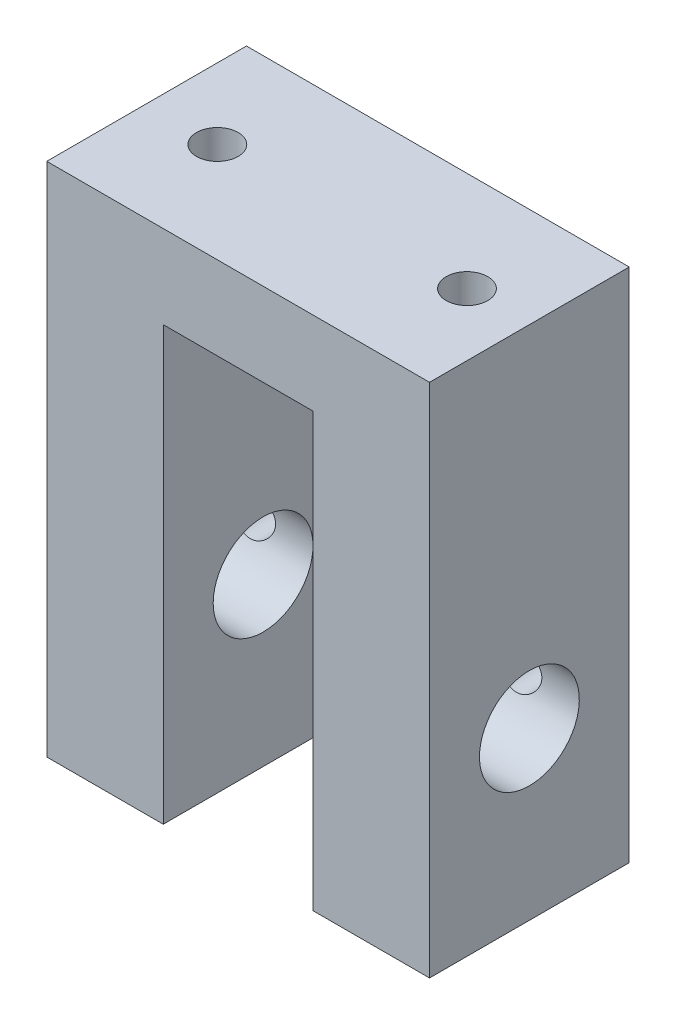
ISO-10303-21;
HEADER;
FILE_DESCRIPTION(('STEP AP214'),'2;1');
FILE_NAME('part.step','',(''),(''),'','','');
FILE_SCHEMA(('AUTOMOTIVE_DESIGN { 1 0 10303 214 1 1 1 1 }'));
ENDSEC;
DATA;
#1=APPLICATION_CONTEXT('core data for automotive mechanical design processes');
#2=APPLICATION_PROTOCOL_DEFINITION('international standard','automotive_design',2000,#1);
#3=PRODUCT_CONTEXT('',#1,'mechanical');
#4=PRODUCT('Part','Part','',(#3));
#5=PRODUCT_RELATED_PRODUCT_CATEGORY('part','',(#4));
#6=PRODUCT_DEFINITION_FORMATION('','',#4);
#7=PRODUCT_DEFINITION_CONTEXT('part definition',#1,'design');
#8=PRODUCT_DEFINITION('design','',#6,#7);
#9=PRODUCT_DEFINITION_SHAPE('','',#8);
#10=(LENGTH_UNIT() NAMED_UNIT(*) SI_UNIT(.MILLI.,.METRE.));
#11=(NAMED_UNIT(*) PLANE_ANGLE_UNIT() SI_UNIT($,.RADIAN.));
#12=(NAMED_UNIT(*) SI_UNIT($,.STERADIAN.) SOLID_ANGLE_UNIT());
#13=UNCERTAINTY_MEASURE_WITH_UNIT(LENGTH_MEASURE(1.E-05),#10,'distance_accuracy_value','');
#14=(GEOMETRIC_REPRESENTATION_CONTEXT(3) GLOBAL_UNCERTAINTY_ASSIGNED_CONTEXT((#13)) GLOBAL_UNIT_ASSIGNED_CONTEXT((#10,
#11,#12)) REPRESENTATION_CONTEXT('',''));
#15=CARTESIAN_POINT('',(0.,0.,0.));
#16=DIRECTION('',(0.,0.,1.));
#17=DIRECTION('',(1.,0.,0.));
#18=AXIS2_PLACEMENT_3D('',#15,#16,#17);
#19=CARTESIAN_POINT('',(-46.6487534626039,-15.6502770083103,24.));
#20=DIRECTION('',(0.,1.,0.));
#21=DIRECTION('',(0.,0.,1.));
#22=AXIS2_PLACEMENT_3D('',#19,#20,#21);
#23=PLANE('',#22);
#24=DIRECTION('',(1.,0.,0.));
#25=VECTOR('',#24,1.);
#26=CARTESIAN_POINT('',(-46.6487534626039,-15.6502770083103,0.));
#27=LINE('',#26,#25);
#28=CARTESIAN_POINT('',(-46.6487534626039,-15.6502770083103,0.));
#29=VERTEX_POINT('',#28);
#30=CARTESIAN_POINT('',(-32.6487534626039,-15.6502770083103,0.));
#31=VERTEX_POINT('',#30);
#32=EDGE_CURVE('E490',#29,#31,#27,.T.);
#33=ORIENTED_EDGE('',*,*,#32,.T.);
#34=DIRECTION('',(0.,0.,1.));
#35=VECTOR('',#34,1.);
#36=CARTESIAN_POINT('',(-32.6487534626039,-15.6502770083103,0.));
#37=LINE('',#36,#35);
#38=CARTESIAN_POINT('',(-32.6487534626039,-15.6502770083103,24.));
#39=VERTEX_POINT('',#38);
#40=EDGE_CURVE('E477',#31,#39,#37,.T.);
#41=ORIENTED_EDGE('',*,*,#40,.T.);
#42=DIRECTION('',(1.,0.,0.));
#43=VECTOR('',#42,1.);
#44=CARTESIAN_POINT('',(-46.6487534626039,-15.6502770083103,24.));
#45=LINE('',#44,#43);
#46=CARTESIAN_POINT('',(-46.6487534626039,-15.6502770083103,24.));
#47=VERTEX_POINT('',#46);
#48=EDGE_CURVE('E500',#47,#39,#45,.T.);
#49=ORIENTED_EDGE('',*,*,#48,.F.);
#50=DIRECTION('',(0.,0.,-1.));
#51=VECTOR('',#50,1.);
#52=CARTESIAN_POINT('',(-46.6487534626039,-15.6502770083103,24.));
#53=LINE('',#52,#51);
#54=EDGE_CURVE('E11',#47,#29,#53,.T.);
#55=ORIENTED_EDGE('',*,*,#54,.T.);
#56=EDGE_LOOP('',(#33,#41,#49,#55));
#57=FACE_BOUND('',#56,.T.);
#58=ADVANCED_FACE('F350',(#57),#23,.F.);
#59=CARTESIAN_POINT('',(-46.6487534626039,46.3497229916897,24.));
#60=DIRECTION('',(1.,0.,0.));
#61=DIRECTION('',(0.,1.,0.));
#62=AXIS2_PLACEMENT_3D('',#59,#60,#61);
#63=PLANE('',#62);
#64=CARTESIAN_POINT('',(-46.6487534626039,4.34972299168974,12.));
#65=DIRECTION('',(1.,0.,0.));
#66=DIRECTION('',(0.,1.,0.));
#67=AXIS2_PLACEMENT_3D('',#64,#65,#66);
#68=CIRCLE('',#67,6.);
#69=CARTESIAN_POINT('',(-46.6487534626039,10.3497229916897,12.));
#70=VERTEX_POINT('',#69);
#71=EDGE_CURVE('E459',#70,#70,#68,.T.);
#72=ORIENTED_EDGE('',*,*,#71,.T.);
#73=EDGE_LOOP('',(#72));
#74=FACE_BOUND('',#73,.T.);
#75=DIRECTION('',(0.,-1.,0.));
#76=VECTOR('',#75,1.);
#77=CARTESIAN_POINT('',(-46.6487534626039,46.3497229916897,0.));
#78=LINE('',#77,#76);
#79=CARTESIAN_POINT('',(-46.6487534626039,46.3497229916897,0.));
#80=VERTEX_POINT('',#79);
#81=EDGE_CURVE('E480',#80,#29,#78,.T.);
#82=ORIENTED_EDGE('',*,*,#81,.T.);
#83=ORIENTED_EDGE('',*,*,#54,.F.);
#84=DIRECTION('',(0.,-1.,0.));
#85=VECTOR('',#84,1.);
#86=CARTESIAN_POINT('',(-46.6487534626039,46.3497229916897,24.));
#87=LINE('',#86,#85);
#88=CARTESIAN_POINT('',(-46.6487534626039,46.3497229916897,24.));
#89=VERTEX_POINT('',#88);
#90=EDGE_CURVE('E497',#89,#47,#87,.T.);
#91=ORIENTED_EDGE('',*,*,#90,.F.);
#92=DIRECTION('',(0.,0.,-1.));
#93=VECTOR('',#92,1.);
#94=CARTESIAN_POINT('',(-46.6487534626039,46.3497229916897,24.));
#95=LINE('',#94,#93);
#96=EDGE_CURVE('E506',#89,#80,#95,.T.);
#97=ORIENTED_EDGE('',*,*,#96,.T.);
#98=EDGE_LOOP('',(#82,#83,#91,#97));
#99=FACE_BOUND('',#98,.T.);
#100=ADVANCED_FACE('F352',(#74,#99),#63,.F.);
#101=CARTESIAN_POINT('',(-14.6487534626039,-15.6502770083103,24.));
#102=VERTEX_POINT('',#101);
#103=CARTESIAN_POINT('',(-0.648753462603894,-15.6502770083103,24.));
#104=VERTEX_POINT('',#103);
#105=EDGE_CURVE('E499',#102,#104,#45,.T.);
#106=ORIENTED_EDGE('',*,*,#105,.F.);
#107=DIRECTION('',(0.,0.,1.));
#108=VECTOR('',#107,1.);
#109=CARTESIAN_POINT('',(-14.6487534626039,-15.6502770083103,0.));
#110=LINE('',#109,#108);
#111=CARTESIAN_POINT('',(-14.6487534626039,-15.6502770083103,0.));
#112=VERTEX_POINT('',#111);
#113=EDGE_CURVE('E483',#112,#102,#110,.T.);
#114=ORIENTED_EDGE('',*,*,#113,.F.);
#115=CARTESIAN_POINT('',(-0.648753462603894,-15.6502770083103,0.));
#116=VERTEX_POINT('',#115);
#117=EDGE_CURVE('E489',#112,#116,#27,.T.);
#118=ORIENTED_EDGE('',*,*,#117,.T.);
#119=DIRECTION('',(0.,0.,-1.));
#120=VECTOR('',#119,1.);
#121=CARTESIAN_POINT('',(-0.648753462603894,-15.6502770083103,24.));
#122=LINE('',#121,#120);
#123=EDGE_CURVE('E363',#104,#116,#122,.T.);
#124=ORIENTED_EDGE('',*,*,#123,.F.);
#125=EDGE_LOOP('',(#106,#114,#118,#124));
#126=FACE_BOUND('',#125,.T.);
#127=ADVANCED_FACE('F545',(#126),#23,.F.);
#128=CARTESIAN_POINT('',(-0.648753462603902,46.3497229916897,24.));
#129=DIRECTION('',(-1.,0.,0.));
#130=DIRECTION('',(0.,-1.,0.));
#131=AXIS2_PLACEMENT_3D('',#128,#129,#130);
#132=PLANE('',#131);
#133=CARTESIAN_POINT('',(-0.648753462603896,4.34972299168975,12.));
#134=DIRECTION('',(1.,0.,0.));
#135=DIRECTION('',(0.,1.,0.));
#136=AXIS2_PLACEMENT_3D('',#133,#134,#135);
#137=CIRCLE('',#136,6.);
#138=CARTESIAN_POINT('',(-0.648753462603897,10.3497229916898,12.));
#139=VERTEX_POINT('',#138);
#140=EDGE_CURVE('E452',#139,#139,#137,.T.);
#141=ORIENTED_EDGE('',*,*,#140,.F.);
#142=EDGE_LOOP('',(#141));
#143=FACE_BOUND('',#142,.T.);
#144=DIRECTION('',(0.,1.,0.));
#145=VECTOR('',#144,1.);
#146=CARTESIAN_POINT('',(-0.648753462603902,46.3497229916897,0.));
#147=LINE('',#146,#145);
#148=CARTESIAN_POINT('',(-0.648753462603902,46.3497229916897,0.));
#149=VERTEX_POINT('',#148);
#150=EDGE_CURVE('E493',#116,#149,#147,.T.);
#151=ORIENTED_EDGE('',*,*,#150,.T.);
#152=DIRECTION('',(0.,0.,-1.));
#153=VECTOR('',#152,1.);
#154=CARTESIAN_POINT('',(-0.648753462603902,46.3497229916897,24.));
#155=LINE('',#154,#153);
#156=CARTESIAN_POINT('',(-0.648753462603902,46.3497229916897,24.));
#157=VERTEX_POINT('',#156);
#158=EDGE_CURVE('E509',#157,#149,#155,.T.);
#159=ORIENTED_EDGE('',*,*,#158,.F.);
#160=DIRECTION('',(0.,1.,0.));
#161=VECTOR('',#160,1.);
#162=CARTESIAN_POINT('',(-0.648753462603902,46.3497229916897,24.));
#163=LINE('',#162,#161);
#164=EDGE_CURVE('E503',#104,#157,#163,.T.);
#165=ORIENTED_EDGE('',*,*,#164,.F.);
#166=ORIENTED_EDGE('',*,*,#123,.T.);
#167=EDGE_LOOP('',(#151,#159,#165,#166));
#168=FACE_BOUND('',#167,.T.);
#169=ADVANCED_FACE('F552',(#143,#168),#132,.F.);
#170=CARTESIAN_POINT('',(-46.6487534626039,46.3497229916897,24.));
#171=DIRECTION('',(0.,-1.,0.));
#172=DIRECTION('',(0.,0.,-1.));
#173=AXIS2_PLACEMENT_3D('',#170,#171,#172);
#174=PLANE('',#173);
#175=CARTESIAN_POINT('',(-8.1487534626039,46.3497229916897,12.));
#176=DIRECTION('',(0.,1.,0.));
#177=DIRECTION('',(0.,0.,1.));
#178=AXIS2_PLACEMENT_3D('',#175,#176,#177);
#179=CIRCLE('',#178,2.49999999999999);
#180=CARTESIAN_POINT('',(-8.1487534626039,46.3497229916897,14.5));
#181=VERTEX_POINT('',#180);
#182=EDGE_CURVE('E436',#181,#181,#179,.T.);
#183=ORIENTED_EDGE('',*,*,#182,.F.);
#184=EDGE_LOOP('',(#183));
#185=FACE_BOUND('',#184,.T.);
#186=CARTESIAN_POINT('',(-38.1487534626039,46.3497229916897,12.));
#187=DIRECTION('',(0.,1.,0.));
#188=DIRECTION('',(0.,0.,1.));
#189=AXIS2_PLACEMENT_3D('',#186,#187,#188);
#190=CIRCLE('',#189,2.49999999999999);
#191=CARTESIAN_POINT('',(-38.1487534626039,46.3497229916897,14.5));
#192=VERTEX_POINT('',#191);
#193=EDGE_CURVE('E449',#192,#192,#190,.T.);
#194=ORIENTED_EDGE('',*,*,#193,.F.);
#195=EDGE_LOOP('',(#194));
#196=FACE_BOUND('',#195,.T.);
#197=DIRECTION('',(-1.,0.,0.));
#198=VECTOR('',#197,1.);
#199=CARTESIAN_POINT('',(-46.6487534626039,46.3497229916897,0.));
#200=LINE('',#199,#198);
#201=EDGE_CURVE('E495',#149,#80,#200,.T.);
#202=ORIENTED_EDGE('',*,*,#201,.T.);
#203=ORIENTED_EDGE('',*,*,#96,.F.);
#204=DIRECTION('',(-1.,0.,0.));
#205=VECTOR('',#204,1.);
#206=CARTESIAN_POINT('',(-46.6487534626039,46.3497229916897,24.));
#207=LINE('',#206,#205);
#208=EDGE_CURVE('E379',#157,#89,#207,.T.);
#209=ORIENTED_EDGE('',*,*,#208,.F.);
#210=ORIENTED_EDGE('',*,*,#158,.T.);
#211=EDGE_LOOP('',(#202,#203,#209,#210));
#212=FACE_BOUND('',#211,.T.);
#213=ADVANCED_FACE('F557',(#185,#196,#212),#174,.F.);
#214=CARTESIAN_POINT('',(-46.6487534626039,-15.6502770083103,24.));
#215=DIRECTION('',(0.,0.,1.));
#216=DIRECTION('',(1.,0.,0.));
#217=AXIS2_PLACEMENT_3D('',#214,#215,#216);
#218=PLANE('',#217);
#219=DIRECTION('',(0.,-1.,0.));
#220=VECTOR('',#219,1.);
#221=CARTESIAN_POINT('',(-32.6487534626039,36.3497229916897,24.));
#222=LINE('',#221,#220);
#223=CARTESIAN_POINT('',(-32.6487534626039,36.3497229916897,24.));
#224=VERTEX_POINT('',#223);
#225=EDGE_CURVE('E462',#224,#39,#222,.T.);
#226=ORIENTED_EDGE('',*,*,#225,.F.);
#227=DIRECTION('',(-1.,0.,0.));
#228=VECTOR('',#227,1.);
#229=CARTESIAN_POINT('',(-32.6487534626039,36.3497229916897,24.));
#230=LINE('',#229,#228);
#231=CARTESIAN_POINT('',(-14.6487534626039,36.3497229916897,24.));
#232=VERTEX_POINT('',#231);
#233=EDGE_CURVE('E467',#232,#224,#230,.T.);
#234=ORIENTED_EDGE('',*,*,#233,.F.);
#235=DIRECTION('',(0.,1.,0.));
#236=VECTOR('',#235,1.);
#237=CARTESIAN_POINT('',(-14.6487534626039,36.3497229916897,24.));
#238=LINE('',#237,#236);
#239=EDGE_CURVE('E464',#102,#232,#238,.T.);
#240=ORIENTED_EDGE('',*,*,#239,.F.);
#241=ORIENTED_EDGE('',*,*,#105,.T.);
#242=ORIENTED_EDGE('',*,*,#164,.T.);
#243=ORIENTED_EDGE('',*,*,#208,.T.);
#244=ORIENTED_EDGE('',*,*,#90,.T.);
#245=ORIENTED_EDGE('',*,*,#48,.T.);
#246=EDGE_LOOP('',(#226,#234,#240,#241,#242,#243,#244,#245));
#247=FACE_BOUND('',#246,.T.);
#248=ADVANCED_FACE('F566',(#247),#218,.T.);
#249=CARTESIAN_POINT('',(-46.6487534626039,-15.6502770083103,0.));
#250=DIRECTION('',(0.,0.,1.));
#251=DIRECTION('',(1.,0.,0.));
#252=AXIS2_PLACEMENT_3D('',#249,#250,#251);
#253=PLANE('',#252);
#254=CARTESIAN_POINT('',(-7.64875346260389,4.34972299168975,0.));
#255=DIRECTION('',(0.,0.,-1.));
#256=DIRECTION('',(-1.,0.,0.));
#257=AXIS2_PLACEMENT_3D('',#254,#255,#256);
#258=CIRCLE('',#257,2.49999999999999);
#259=CARTESIAN_POINT('',(-10.1487534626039,4.34972299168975,0.));
#260=VERTEX_POINT('',#259);
#261=EDGE_CURVE('E674',#260,#260,#258,.T.);
#262=ORIENTED_EDGE('',*,*,#261,.F.);
#263=EDGE_LOOP('',(#262));
#264=FACE_BOUND('',#263,.T.);
#265=CARTESIAN_POINT('',(-39.6487534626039,4.34972299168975,0.));
#266=DIRECTION('',(0.,0.,-1.));
#267=DIRECTION('',(-1.,0.,0.));
#268=AXIS2_PLACEMENT_3D('',#265,#266,#267);
#269=CIRCLE('',#268,2.49999999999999);
#270=CARTESIAN_POINT('',(-42.1487534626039,4.34972299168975,0.));
#271=VERTEX_POINT('',#270);
#272=EDGE_CURVE('E443',#271,#271,#269,.T.);
#273=ORIENTED_EDGE('',*,*,#272,.F.);
#274=EDGE_LOOP('',(#273));
#275=FACE_BOUND('',#274,.T.);
#276=DIRECTION('',(-1.,0.,0.));
#277=VECTOR('',#276,1.);
#278=CARTESIAN_POINT('',(-32.6487534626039,36.3497229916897,0.));
#279=LINE('',#278,#277);
#280=CARTESIAN_POINT('',(-14.6487534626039,36.3497229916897,0.));
#281=VERTEX_POINT('',#280);
#282=CARTESIAN_POINT('',(-32.6487534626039,36.3497229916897,0.));
#283=VERTEX_POINT('',#282);
#284=EDGE_CURVE('E371',#281,#283,#279,.T.);
#285=ORIENTED_EDGE('',*,*,#284,.T.);
#286=DIRECTION('',(0.,-1.,0.));
#287=VECTOR('',#286,1.);
#288=CARTESIAN_POINT('',(-32.6487534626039,36.3497229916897,0.));
#289=LINE('',#288,#287);
#290=EDGE_CURVE('E470',#283,#31,#289,.T.);
#291=ORIENTED_EDGE('',*,*,#290,.T.);
#292=ORIENTED_EDGE('',*,*,#32,.F.);
#293=ORIENTED_EDGE('',*,*,#81,.F.);
#294=ORIENTED_EDGE('',*,*,#201,.F.);
#295=ORIENTED_EDGE('',*,*,#150,.F.);
#296=ORIENTED_EDGE('',*,*,#117,.F.);
#297=DIRECTION('',(0.,1.,0.));
#298=VECTOR('',#297,1.);
#299=CARTESIAN_POINT('',(-14.6487534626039,36.3497229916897,0.));
#300=LINE('',#299,#298);
#301=EDGE_CURVE('E473',#112,#281,#300,.T.);
#302=ORIENTED_EDGE('',*,*,#301,.T.);
#303=EDGE_LOOP('',(#285,#291,#292,#293,#294,#295,#296,#302));
#304=FACE_BOUND('',#303,.T.);
#305=ADVANCED_FACE('F572',(#264,#275,#304),#253,.F.);
#306=CARTESIAN_POINT('',(-32.6487534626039,36.3497229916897,0.));
#307=DIRECTION('',(-1.,0.,0.));
#308=DIRECTION('',(0.,-1.,0.));
#309=AXIS2_PLACEMENT_3D('',#306,#307,#308);
#310=PLANE('',#309);
#311=CARTESIAN_POINT('',(-32.6487534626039,4.34972299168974,12.));
#312=DIRECTION('',(-1.,0.,0.));
#313=DIRECTION('',(0.,-1.,0.));
#314=AXIS2_PLACEMENT_3D('',#311,#312,#313);
#315=CIRCLE('',#314,6.);
#316=CARTESIAN_POINT('',(-32.6487534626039,-1.65027700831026,12.));
#317=VERTEX_POINT('',#316);
#318=EDGE_CURVE('E456',#317,#317,#315,.T.);
#319=ORIENTED_EDGE('',*,*,#318,.T.);
#320=EDGE_LOOP('',(#319));
#321=FACE_BOUND('',#320,.T.);
#322=ORIENTED_EDGE('',*,*,#225,.T.);
#323=ORIENTED_EDGE('',*,*,#40,.F.);
#324=ORIENTED_EDGE('',*,*,#290,.F.);
#325=DIRECTION('',(0.,0.,1.));
#326=VECTOR('',#325,1.);
#327=CARTESIAN_POINT('',(-32.6487534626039,36.3497229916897,0.));
#328=LINE('',#327,#326);
#329=EDGE_CURVE('E478',#283,#224,#328,.T.);
#330=ORIENTED_EDGE('',*,*,#329,.T.);
#331=EDGE_LOOP('',(#322,#323,#324,#330));
#332=FACE_BOUND('',#331,.T.);
#333=ADVANCED_FACE('F583',(#321,#332),#310,.F.);
#334=CARTESIAN_POINT('',(-32.6487534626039,36.3497229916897,0.));
#335=DIRECTION('',(0.,1.,0.));
#336=DIRECTION('',(0.,0.,1.));
#337=AXIS2_PLACEMENT_3D('',#334,#335,#336);
#338=PLANE('',#337);
#339=ORIENTED_EDGE('',*,*,#233,.T.);
#340=ORIENTED_EDGE('',*,*,#329,.F.);
#341=ORIENTED_EDGE('',*,*,#284,.F.);
#342=DIRECTION('',(0.,0.,1.));
#343=VECTOR('',#342,1.);
#344=CARTESIAN_POINT('',(-14.6487534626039,36.3497229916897,0.));
#345=LINE('',#344,#343);
#346=EDGE_CURVE('E481',#281,#232,#345,.T.);
#347=ORIENTED_EDGE('',*,*,#346,.T.);
#348=EDGE_LOOP('',(#339,#340,#341,#347));
#349=FACE_BOUND('',#348,.T.);
#350=ADVANCED_FACE('F584',(#349),#338,.F.);
#351=CARTESIAN_POINT('',(-14.6487534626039,36.3497229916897,0.));
#352=DIRECTION('',(1.,0.,0.));
#353=DIRECTION('',(0.,1.,0.));
#354=AXIS2_PLACEMENT_3D('',#351,#352,#353);
#355=PLANE('',#354);
#356=CARTESIAN_POINT('',(-14.6487534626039,4.34972299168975,12.));
#357=DIRECTION('',(1.,0.,0.));
#358=DIRECTION('',(0.,1.,0.));
#359=AXIS2_PLACEMENT_3D('',#356,#357,#358);
#360=CIRCLE('',#359,6.);
#361=CARTESIAN_POINT('',(-14.6487534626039,10.3497229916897,12.));
#362=VERTEX_POINT('',#361);
#363=EDGE_CURVE('E455',#362,#362,#360,.T.);
#364=ORIENTED_EDGE('',*,*,#363,.T.);
#365=EDGE_LOOP('',(#364));
#366=FACE_BOUND('',#365,.T.);
#367=ORIENTED_EDGE('',*,*,#239,.T.);
#368=ORIENTED_EDGE('',*,*,#346,.F.);
#369=ORIENTED_EDGE('',*,*,#301,.F.);
#370=ORIENTED_EDGE('',*,*,#113,.T.);
#371=EDGE_LOOP('',(#367,#368,#369,#370));
#372=FACE_BOUND('',#371,.T.);
#373=ADVANCED_FACE('F570',(#366,#372),#355,.F.);
#374=CARTESIAN_POINT('',(-56.6487534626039,4.34972299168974,12.));
#375=DIRECTION('',(1.,0.,0.));
#376=DIRECTION('',(0.,1.,0.));
#377=AXIS2_PLACEMENT_3D('',#374,#375,#376);
#378=CYLINDRICAL_SURFACE('',#377,6.);
#379=CARTESIAN_POINT('',(-10.1487534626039,4.34972299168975,6.));
#380=CARTESIAN_POINT('',(-10.1487487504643,4.48362690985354,6.00000371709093));
#381=CARTESIAN_POINT('',(-10.1379321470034,4.61776251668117,6.00453343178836));
#382=CARTESIAN_POINT('',(-10.0950727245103,4.88222101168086,6.02219884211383));
#383=CARTESIAN_POINT('',(-10.0629745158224,5.01253302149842,6.03535699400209));
#384=CARTESIAN_POINT('',(-9.97893197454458,5.26509958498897,6.06887370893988));
#385=CARTESIAN_POINT('',(-9.9270548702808,5.38737980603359,6.08920786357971));
#386=CARTESIAN_POINT('',(-9.80520762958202,5.62138273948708,6.1350944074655));
#387=CARTESIAN_POINT('',(-9.73524297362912,5.73310863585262,6.16064521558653));
#388=CARTESIAN_POINT('',(-9.57549555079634,5.94861973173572,6.21584339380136));
#389=CARTESIAN_POINT('',(-9.48495085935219,6.05180550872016,6.24562492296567));
#390=CARTESIAN_POINT('',(-9.28822477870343,6.24204265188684,6.30534572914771));
#391=CARTESIAN_POINT('',(-9.1820352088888,6.32908552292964,6.33528508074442));
#392=CARTESIAN_POINT('',(-8.95069991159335,6.48879774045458,6.39357956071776));
#393=CARTESIAN_POINT('',(-8.82487856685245,6.56054915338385,6.42178426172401));
#394=CARTESIAN_POINT('',(-8.56160694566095,6.68160180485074,6.47128855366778));
#395=CARTESIAN_POINT('',(-8.42416270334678,6.73091460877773,6.49259170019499));
#396=CARTESIAN_POINT('',(-8.14844607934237,6.80321495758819,6.52442889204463));
#397=CARTESIAN_POINT('',(-8.01053249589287,6.82735614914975,6.53543224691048));
#398=CARTESIAN_POINT('',(-7.7322068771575,6.85222719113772,6.54677347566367));
#399=CARTESIAN_POINT('',(-7.59179626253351,6.85296995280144,6.54711723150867));
#400=CARTESIAN_POINT('',(-7.32395334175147,6.83189199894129,6.53749760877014));
#401=CARTESIAN_POINT('',(-7.19635126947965,6.81179661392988,6.52832234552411));
#402=CARTESIAN_POINT('',(-6.94652928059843,6.75250681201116,6.50203034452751));
#403=CARTESIAN_POINT('',(-6.82431039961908,6.71330873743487,6.48491208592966));
#404=CARTESIAN_POINT('',(-6.5856380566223,6.61616216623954,6.44427630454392));
#405=CARTESIAN_POINT('',(-6.46936262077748,6.55783242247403,6.42063036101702));
#406=CARTESIAN_POINT('',(-6.24779799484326,6.42434784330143,6.36963337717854));
#407=CARTESIAN_POINT('',(-6.14251316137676,6.34918637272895,6.34228087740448));
#408=CARTESIAN_POINT('',(-5.93655354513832,6.17671492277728,6.28414046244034));
#409=CARTESIAN_POINT('',(-5.83702032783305,6.07806995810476,6.25325757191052));
#410=CARTESIAN_POINT('',(-5.65552645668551,5.8651821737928,6.19348653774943));
#411=CARTESIAN_POINT('',(-5.57356991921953,5.75093571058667,6.16459886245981));
#412=CARTESIAN_POINT('',(-5.42788181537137,5.50661888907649,6.11123432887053));
#413=CARTESIAN_POINT('',(-5.36461457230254,5.3762441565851,6.08687466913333));
#414=CARTESIAN_POINT('',(-5.26131118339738,5.10542779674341,6.04621037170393));
#415=CARTESIAN_POINT('',(-5.22126219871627,4.96499178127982,6.029901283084));
#416=CARTESIAN_POINT('',(-5.16792147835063,4.6875792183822,6.0080071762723));
#417=CARTESIAN_POINT('',(-5.1530977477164,4.55094556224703,6.0018091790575));
#418=CARTESIAN_POINT('',(-5.14606101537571,4.27701368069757,5.99887899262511));
#419=CARTESIAN_POINT('',(-5.1538415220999,4.13971565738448,6.00214408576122));
#420=CARTESIAN_POINT('',(-5.19069563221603,3.87552650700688,6.0173756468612));
#421=CARTESIAN_POINT('',(-5.21869337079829,3.74845705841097,6.02890225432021));
#422=CARTESIAN_POINT('',(-5.29368985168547,3.50095749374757,6.05902786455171));
#423=CARTESIAN_POINT('',(-5.34069099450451,3.38052821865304,6.07762776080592));
#424=CARTESIAN_POINT('',(-5.45389541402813,3.14550499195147,6.12083458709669));
#425=CARTESIAN_POINT('',(-5.52064982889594,3.03120851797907,6.14561017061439));
#426=CARTESIAN_POINT('',(-5.67086021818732,2.81503055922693,6.19852390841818));
#427=CARTESIAN_POINT('',(-5.75432316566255,2.713154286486,6.22666346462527));
#428=CARTESIAN_POINT('',(-5.94255992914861,2.51705613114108,6.28575824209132));
#429=CARTESIAN_POINT('',(-6.048430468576,2.42390159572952,6.31677096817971));
#430=CARTESIAN_POINT('',(-6.2747960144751,2.25638329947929,6.3763132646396));
#431=CARTESIAN_POINT('',(-6.39529433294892,2.18202380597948,6.40484227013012));
#432=CARTESIAN_POINT('',(-6.64998181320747,2.05340378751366,6.45637227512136));
#433=CARTESIAN_POINT('',(-6.78434153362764,1.99944462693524,6.47928874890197));
#434=CARTESIAN_POINT('',(-7.06149465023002,1.91537471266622,6.51583288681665));
#435=CARTESIAN_POINT('',(-7.20428098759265,1.88524429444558,6.52946820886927));
#436=CARTESIAN_POINT('',(-7.48239086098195,1.85164138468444,6.5447367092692));
#437=CARTESIAN_POINT('',(-7.61744278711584,1.84629538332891,6.54721298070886));
#438=CARTESIAN_POINT('',(-7.88643918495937,1.85741148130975,6.54212293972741));
#439=CARTESIAN_POINT('',(-8.020383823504,1.87387023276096,6.53455816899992));
#440=CARTESIAN_POINT('',(-8.27693895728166,1.92655489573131,6.51100897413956));
#441=CARTESIAN_POINT('',(-8.39978680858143,1.96182491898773,6.49543290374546));
#442=CARTESIAN_POINT('',(-8.63784950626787,2.05019642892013,6.45793637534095));
#443=CARTESIAN_POINT('',(-8.7530621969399,2.10330292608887,6.43601413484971));
#444=CARTESIAN_POINT('',(-8.98014525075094,2.22951726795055,6.38666091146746));
#445=CARTESIAN_POINT('',(-9.0913981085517,2.30363575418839,6.35897795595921));
#446=CARTESIAN_POINT('',(-9.30047375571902,2.46835486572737,6.30192620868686));
#447=CARTESIAN_POINT('',(-9.3982918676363,2.5589612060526,6.27255683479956));
#448=CARTESIAN_POINT('',(-9.58505076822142,2.76191882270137,6.21287218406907));
#449=CARTESIAN_POINT('',(-9.67282610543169,2.87537321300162,6.1826438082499));
#450=CARTESIAN_POINT('',(-9.828152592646,3.11652313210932,6.12679696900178));
#451=CARTESIAN_POINT('',(-9.89569452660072,3.24422511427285,6.10118060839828));
#452=CARTESIAN_POINT('',(-10.0071723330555,3.50825777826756,6.05781691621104));
#453=CARTESIAN_POINT('',(-10.051479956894,3.64441093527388,6.03994650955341));
#454=CARTESIAN_POINT('',(-10.1161691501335,3.92290620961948,6.0135776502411));
#455=CARTESIAN_POINT('',(-10.1366256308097,4.06522748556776,6.00504985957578));
#456=CARTESIAN_POINT('',(-10.1460773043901,4.23167047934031,6.00111433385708));
#457=CARTESIAN_POINT('',(-10.1470800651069,4.25526605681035,6.00069707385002));
#458=CARTESIAN_POINT('',(-10.1484185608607,4.30247968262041,6.00013957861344));
#459=CARTESIAN_POINT('',(-10.1487542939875,4.3260977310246,5.9999993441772));
#460=CARTESIAN_POINT('',(-10.1487534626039,4.34972299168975,6.));
#461=B_SPLINE_CURVE_WITH_KNOTS('',3,(#379,#380,#381,#382,#383,#384,#385,#386,#387,#388,#389,
#390,#391,#392,#393,#394,#395,#396,#397,#398,#399,#400,#401,#402,#403,#404,#405,#406,#407,#408,
#409,#410,#411,#412,#413,#414,#415,#416,#417,#418,#419,#420,#421,#422,#423,#424,#425,#426,#427,
#428,#429,#430,#431,#432,#433,#434,#435,#436,#437,#438,#439,#440,#441,#442,#443,#444,#445,#446,
#447,#448,#449,#450,#451,#452,#453,#454,#455,#456,#457,#458,#459,#460),.UNSPECIFIED.,.T.,.F.,(4,
2,2,2,2,2,2,2,2,2,2,2,2,2,2,2,2,2,2,2,2,2,2,2,2,2,2,2,2,2,2,2,2,2,2,2,2,2,2,2,4),(0.,
0.401613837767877,0.804277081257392,1.2055837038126,1.60676887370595,2.02635872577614,
2.4461687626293,2.8866344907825,3.32687293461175,3.74590546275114,4.16470676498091,
4.55140314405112,4.93817359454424,5.33317426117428,5.72833091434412,6.15688282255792,
6.58553498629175,7.02408110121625,7.46238448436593,7.872968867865,8.28343534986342,
8.67353179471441,9.06367753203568,9.4659427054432,9.8683761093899,10.2995697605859,
10.7308612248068,11.1682957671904,11.6053689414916,12.0087975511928,12.4121642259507,
12.7967529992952,13.1814498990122,13.5892778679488,13.9972474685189,14.4349307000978,
14.8728129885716,15.3034571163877,15.7327450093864,15.8036033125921,15.8744618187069),.UNSPECIFIED.);
#462=CARTESIAN_POINT('',(-10.1487534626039,4.34972299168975,6.));
#463=VERTEX_POINT('',#462);
#464=EDGE_CURVE('E354',#463,#463,#461,.T.);
#465=ORIENTED_EDGE('',*,*,#464,.T.);
#466=EDGE_LOOP('',(#465));
#467=FACE_BOUND('',#466,.T.);
#468=ORIENTED_EDGE('',*,*,#140,.T.);
#469=EDGE_LOOP('',(#468));
#470=FACE_BOUND('',#469,.T.);
#471=ORIENTED_EDGE('',*,*,#363,.F.);
#472=EDGE_LOOP('',(#471));
#473=FACE_BOUND('',#472,.T.);
#474=ADVANCED_FACE('F539',(#467,#470,#473),#378,.F.);
#475=CARTESIAN_POINT('',(-42.1487534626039,4.34972299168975,6.));
#476=CARTESIAN_POINT('',(-42.1487487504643,4.48362690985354,6.00000371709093));
#477=CARTESIAN_POINT('',(-42.1379321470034,4.61776251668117,6.00453343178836));
#478=CARTESIAN_POINT('',(-42.0950727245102,4.88222101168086,6.02219884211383));
#479=CARTESIAN_POINT('',(-42.0629745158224,5.01253302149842,6.03535699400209));
#480=CARTESIAN_POINT('',(-41.9789319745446,5.26509958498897,6.06887370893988));
#481=CARTESIAN_POINT('',(-41.9270548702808,5.38737980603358,6.08920786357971));
#482=CARTESIAN_POINT('',(-41.805207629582,5.62138273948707,6.1350944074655));
#483=CARTESIAN_POINT('',(-41.7352429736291,5.73310863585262,6.16064521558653));
#484=CARTESIAN_POINT('',(-41.5754955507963,5.94861973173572,6.21584339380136));
#485=CARTESIAN_POINT('',(-41.4849508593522,6.05180550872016,6.24562492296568));
#486=CARTESIAN_POINT('',(-41.2882247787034,6.24204265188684,6.30534572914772));
#487=CARTESIAN_POINT('',(-41.1820352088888,6.32908552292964,6.33528508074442));
#488=CARTESIAN_POINT('',(-40.9506999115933,6.48879774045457,6.39357956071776));
#489=CARTESIAN_POINT('',(-40.8248785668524,6.56054915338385,6.42178426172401));
#490=CARTESIAN_POINT('',(-40.5616069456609,6.68160180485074,6.47128855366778));
#491=CARTESIAN_POINT('',(-40.4241627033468,6.73091460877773,6.49259170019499));
#492=CARTESIAN_POINT('',(-40.1484460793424,6.80321495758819,6.52442889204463));
#493=CARTESIAN_POINT('',(-40.0105324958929,6.82735614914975,6.53543224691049));
#494=CARTESIAN_POINT('',(-39.7322068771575,6.85222719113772,6.54677347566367));
#495=CARTESIAN_POINT('',(-39.5917962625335,6.85296995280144,6.54711723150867));
#496=CARTESIAN_POINT('',(-39.3239533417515,6.83189199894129,6.53749760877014));
#497=CARTESIAN_POINT('',(-39.1963512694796,6.81179661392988,6.52832234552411));
#498=CARTESIAN_POINT('',(-38.9465292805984,6.75250681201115,6.50203034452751));
#499=CARTESIAN_POINT('',(-38.8243103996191,6.71330873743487,6.48491208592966));
#500=CARTESIAN_POINT('',(-38.5856380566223,6.61616216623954,6.44427630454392));
#501=CARTESIAN_POINT('',(-38.4693626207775,6.55783242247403,6.42063036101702));
#502=CARTESIAN_POINT('',(-38.2477979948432,6.42434784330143,6.36963337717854));
#503=CARTESIAN_POINT('',(-38.1425131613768,6.34918637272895,6.34228087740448));
#504=CARTESIAN_POINT('',(-37.9365535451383,6.17671492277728,6.28414046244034));
#505=CARTESIAN_POINT('',(-37.8370203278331,6.07806995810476,6.25325757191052));
#506=CARTESIAN_POINT('',(-37.6555264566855,5.8651821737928,6.19348653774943));
#507=CARTESIAN_POINT('',(-37.5735699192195,5.75093571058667,6.16459886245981));
#508=CARTESIAN_POINT('',(-37.4278818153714,5.50661888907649,6.11123432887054));
#509=CARTESIAN_POINT('',(-37.3646145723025,5.3762441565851,6.08687466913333));
#510=CARTESIAN_POINT('',(-37.2613111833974,5.10542779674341,6.04621037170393));
#511=CARTESIAN_POINT('',(-37.2212621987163,4.96499178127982,6.029901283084));
#512=CARTESIAN_POINT('',(-37.1679214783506,4.68757921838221,6.0080071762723));
#513=CARTESIAN_POINT('',(-37.1530977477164,4.55094556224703,6.0018091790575));
#514=CARTESIAN_POINT('',(-37.1460610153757,4.27701368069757,5.99887899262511));
#515=CARTESIAN_POINT('',(-37.1538415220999,4.13971565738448,6.00214408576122));
#516=CARTESIAN_POINT('',(-37.190695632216,3.87552650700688,6.0173756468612));
#517=CARTESIAN_POINT('',(-37.2186933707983,3.74845705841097,6.02890225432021));
#518=CARTESIAN_POINT('',(-37.2936898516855,3.50095749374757,6.05902786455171));
#519=CARTESIAN_POINT('',(-37.3406909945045,3.38052821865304,6.07762776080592));
#520=CARTESIAN_POINT('',(-37.4538954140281,3.14550499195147,6.12083458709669));
#521=CARTESIAN_POINT('',(-37.5206498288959,3.03120851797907,6.14561017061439));
#522=CARTESIAN_POINT('',(-37.6708602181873,2.81503055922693,6.19852390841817));
#523=CARTESIAN_POINT('',(-37.7543231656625,2.713154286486,6.22666346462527));
#524=CARTESIAN_POINT('',(-37.9425599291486,2.51705613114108,6.28575824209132));
#525=CARTESIAN_POINT('',(-38.048430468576,2.42390159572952,6.31677096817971));
#526=CARTESIAN_POINT('',(-38.2747960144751,2.25638329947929,6.3763132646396));
#527=CARTESIAN_POINT('',(-38.3952943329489,2.18202380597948,6.40484227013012));
#528=CARTESIAN_POINT('',(-38.6499818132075,2.05340378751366,6.45637227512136));
#529=CARTESIAN_POINT('',(-38.7843415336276,1.99944462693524,6.47928874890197));
#530=CARTESIAN_POINT('',(-39.06149465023,1.91537471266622,6.51583288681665));
#531=CARTESIAN_POINT('',(-39.2042809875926,1.88524429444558,6.52946820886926));
#532=CARTESIAN_POINT('',(-39.4823908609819,1.85164138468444,6.5447367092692));
#533=CARTESIAN_POINT('',(-39.6174427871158,1.84629538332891,6.54721298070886));
#534=CARTESIAN_POINT('',(-39.8864391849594,1.85741148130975,6.54212293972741));
#535=CARTESIAN_POINT('',(-40.020383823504,1.87387023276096,6.53455816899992));
#536=CARTESIAN_POINT('',(-40.2769389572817,1.92655489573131,6.51100897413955));
#537=CARTESIAN_POINT('',(-40.3997868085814,1.96182491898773,6.49543290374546));
#538=CARTESIAN_POINT('',(-40.6378495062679,2.05019642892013,6.45793637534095));
#539=CARTESIAN_POINT('',(-40.7530621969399,2.10330292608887,6.43601413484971));
#540=CARTESIAN_POINT('',(-40.9801452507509,2.22951726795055,6.38666091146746));
#541=CARTESIAN_POINT('',(-41.0913981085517,2.30363575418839,6.35897795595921));
#542=CARTESIAN_POINT('',(-41.300473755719,2.46835486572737,6.30192620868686));
#543=CARTESIAN_POINT('',(-41.3982918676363,2.5589612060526,6.27255683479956));
#544=CARTESIAN_POINT('',(-41.5850507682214,2.76191882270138,6.21287218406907));
#545=CARTESIAN_POINT('',(-41.6728261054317,2.87537321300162,6.1826438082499));
#546=CARTESIAN_POINT('',(-41.828152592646,3.11652313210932,6.12679696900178));
#547=CARTESIAN_POINT('',(-41.8956945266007,3.24422511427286,6.10118060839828));
#548=CARTESIAN_POINT('',(-42.0071723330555,3.50825777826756,6.05781691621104));
#549=CARTESIAN_POINT('',(-42.051479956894,3.64441093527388,6.03994650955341));
#550=CARTESIAN_POINT('',(-42.1161691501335,3.92290620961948,6.0135776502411));
#551=CARTESIAN_POINT('',(-42.1366256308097,4.06522748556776,6.00504985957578));
#552=CARTESIAN_POINT('',(-42.1460773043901,4.23167047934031,6.00111433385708));
#553=CARTESIAN_POINT('',(-42.1470800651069,4.25526605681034,6.00069707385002));
#554=CARTESIAN_POINT('',(-42.1484185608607,4.30247968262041,6.00013957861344));
#555=CARTESIAN_POINT('',(-42.1487542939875,4.3260977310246,5.9999993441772));
#556=CARTESIAN_POINT('',(-42.1487534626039,4.34972299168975,6.));
#557=B_SPLINE_CURVE_WITH_KNOTS('',3,(#475,#476,#477,#478,#479,#480,#481,#482,#483,#484,#485,
#486,#487,#488,#489,#490,#491,#492,#493,#494,#495,#496,#497,#498,#499,#500,#501,#502,#503,#504,
#505,#506,#507,#508,#509,#510,#511,#512,#513,#514,#515,#516,#517,#518,#519,#520,#521,#522,#523,
#524,#525,#526,#527,#528,#529,#530,#531,#532,#533,#534,#535,#536,#537,#538,#539,#540,#541,#542,
#543,#544,#545,#546,#547,#548,#549,#550,#551,#552,#553,#554,#555,#556),.UNSPECIFIED.,.T.,.F.,(4,
2,2,2,2,2,2,2,2,2,2,2,2,2,2,2,2,2,2,2,2,2,2,2,2,2,2,2,2,2,2,2,2,2,2,2,2,2,2,2,4),(0.,
0.401613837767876,0.804277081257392,1.2055837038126,1.60676887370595,2.02635872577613,
2.44616876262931,2.8866344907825,3.32687293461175,3.74590546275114,4.16470676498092,
4.55140314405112,4.93817359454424,5.33317426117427,5.72833091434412,6.15688282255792,
6.58553498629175,7.02408110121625,7.46238448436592,7.872968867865,8.28343534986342,
8.67353179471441,9.06367753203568,9.4659427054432,9.86837610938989,10.2995697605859,
10.7308612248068,11.1682957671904,11.6053689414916,12.0087975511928,12.4121642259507,
12.7967529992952,13.1814498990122,13.5892778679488,13.9972474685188,14.4349307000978,
14.8728129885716,15.3034571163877,15.7327450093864,15.8036033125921,15.8744618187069),.UNSPECIFIED.);
#558=CARTESIAN_POINT('',(-42.1487534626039,4.34972299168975,6.));
#559=VERTEX_POINT('',#558);
#560=EDGE_CURVE('E437',#559,#559,#557,.T.);
#561=ORIENTED_EDGE('',*,*,#560,.T.);
#562=EDGE_LOOP('',(#561));
#563=FACE_BOUND('',#562,.T.);
#564=ORIENTED_EDGE('',*,*,#318,.F.);
#565=EDGE_LOOP('',(#564));
#566=FACE_BOUND('',#565,.T.);
#567=ORIENTED_EDGE('',*,*,#71,.F.);
#568=EDGE_LOOP('',(#567));
#569=FACE_BOUND('',#568,.T.);
#570=ADVANCED_FACE('F518',(#563,#566,#569),#378,.F.);
#571=CARTESIAN_POINT('',(-38.1487534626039,46.3497229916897,12.));
#572=DIRECTION('',(0.,1.,0.));
#573=DIRECTION('',(0.,0.,1.));
#574=AXIS2_PLACEMENT_3D('',#571,#572,#573);
#575=CYLINDRICAL_SURFACE('',#574,2.49999999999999);
#576=CARTESIAN_POINT('',(-38.1487534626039,16.3497229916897,12.));
#577=DIRECTION('',(0.,1.,0.));
#578=DIRECTION('',(0.,0.,1.));
#579=AXIS2_PLACEMENT_3D('',#576,#577,#578);
#580=CIRCLE('',#579,2.49999999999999);
#581=CARTESIAN_POINT('',(-38.1487534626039,16.3497229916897,14.5));
#582=VERTEX_POINT('',#581);
#583=EDGE_CURVE('E440',#582,#582,#580,.T.);
#584=ORIENTED_EDGE('',*,*,#583,.F.);
#585=EDGE_LOOP('',(#584));
#586=FACE_BOUND('',#585,.T.);
#587=ORIENTED_EDGE('',*,*,#193,.T.);
#588=EDGE_LOOP('',(#587));
#589=FACE_BOUND('',#588,.T.);
#590=ADVANCED_FACE('F532',(#586,#589),#575,.F.);
#591=CARTESIAN_POINT('',(-38.1487534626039,16.3497229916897,12.));
#592=DIRECTION('',(0.,1.,0.));
#593=DIRECTION('',(0.,0.,1.));
#594=AXIS2_PLACEMENT_3D('',#591,#592,#593);
#595=CONICAL_SURFACE('',#594,2.49999999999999,1.02974425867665);
#596=CARTESIAN_POINT('',(-38.1487534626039,14.8475714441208,12.));
#597=VERTEX_POINT('',#596);
#598=VERTEX_LOOP('',#597);
#599=FACE_BOUND('',#598,.T.);
#600=ORIENTED_EDGE('',*,*,#583,.T.);
#601=EDGE_LOOP('',(#600));
#602=FACE_BOUND('',#601,.T.);
#603=ADVANCED_FACE('F530',(#599,#602),#595,.F.);
#604=CARTESIAN_POINT('',(-8.1487534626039,46.3497229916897,12.));
#605=DIRECTION('',(0.,1.,0.));
#606=DIRECTION('',(0.,0.,1.));
#607=AXIS2_PLACEMENT_3D('',#604,#605,#606);
#608=CYLINDRICAL_SURFACE('',#607,2.49999999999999);
#609=CARTESIAN_POINT('',(-8.1487534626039,16.3497229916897,12.));
#610=DIRECTION('',(0.,1.,0.));
#611=DIRECTION('',(0.,0.,1.));
#612=AXIS2_PLACEMENT_3D('',#609,#610,#611);
#613=CIRCLE('',#612,2.49999999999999);
#614=CARTESIAN_POINT('',(-8.1487534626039,16.3497229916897,14.5));
#615=VERTEX_POINT('',#614);
#616=EDGE_CURVE('E434',#615,#615,#613,.T.);
#617=ORIENTED_EDGE('',*,*,#616,.F.);
#618=EDGE_LOOP('',(#617));
#619=FACE_BOUND('',#618,.T.);
#620=ORIENTED_EDGE('',*,*,#182,.T.);
#621=EDGE_LOOP('',(#620));
#622=FACE_BOUND('',#621,.T.);
#623=ADVANCED_FACE('F430',(#619,#622),#608,.F.);
#624=CARTESIAN_POINT('',(-8.1487534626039,16.3497229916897,12.));
#625=DIRECTION('',(0.,1.,0.));
#626=DIRECTION('',(0.,0.,1.));
#627=AXIS2_PLACEMENT_3D('',#624,#625,#626);
#628=CONICAL_SURFACE('',#627,2.49999999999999,1.02974425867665);
#629=CARTESIAN_POINT('',(-8.14875346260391,14.8475714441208,12.));
#630=VERTEX_POINT('',#629);
#631=VERTEX_LOOP('',#630);
#632=FACE_BOUND('',#631,.T.);
#633=ORIENTED_EDGE('',*,*,#616,.T.);
#634=EDGE_LOOP('',(#633));
#635=FACE_BOUND('',#634,.T.);
#636=ADVANCED_FACE('F426',(#632,#635),#628,.F.);
#637=CARTESIAN_POINT('',(-39.6487534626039,4.34972299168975,0.));
#638=DIRECTION('',(0.,0.,-1.));
#639=DIRECTION('',(-1.,0.,0.));
#640=AXIS2_PLACEMENT_3D('',#637,#638,#639);
#641=CYLINDRICAL_SURFACE('',#640,2.49999999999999);
#642=ORIENTED_EDGE('',*,*,#272,.T.);
#643=EDGE_LOOP('',(#642));
#644=FACE_BOUND('',#643,.T.);
#645=ORIENTED_EDGE('',*,*,#560,.F.);
#646=EDGE_LOOP('',(#645));
#647=FACE_BOUND('',#646,.T.);
#648=ADVANCED_FACE('F429',(#644,#647),#641,.F.);
#649=CARTESIAN_POINT('',(-7.64875346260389,4.34972299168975,0.));
#650=DIRECTION('',(0.,0.,-1.));
#651=DIRECTION('',(-1.,0.,0.));
#652=AXIS2_PLACEMENT_3D('',#649,#650,#651);
#653=CYLINDRICAL_SURFACE('',#652,2.49999999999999);
#654=ORIENTED_EDGE('',*,*,#261,.T.);
#655=EDGE_LOOP('',(#654));
#656=FACE_BOUND('',#655,.T.);
#657=ORIENTED_EDGE('',*,*,#464,.F.);
#658=EDGE_LOOP('',(#657));
#659=FACE_BOUND('',#658,.T.);
#660=ADVANCED_FACE('F524',(#656,#659),#653,.F.);
#661=CLOSED_SHELL('',(#58,#100,#127,#169,#213,#248,#305,#333,#350,#373,#474,#570,#590,#603,#623,
#636,#648,#660));
#662=MANIFOLD_SOLID_BREP('B2',#661);
#663=ADVANCED_BREP_SHAPE_REPRESENTATION('',(#18,#662),#14);
#664=SHAPE_DEFINITION_REPRESENTATION(#9,#663);
ENDSEC;
END-ISO-10303-21;
